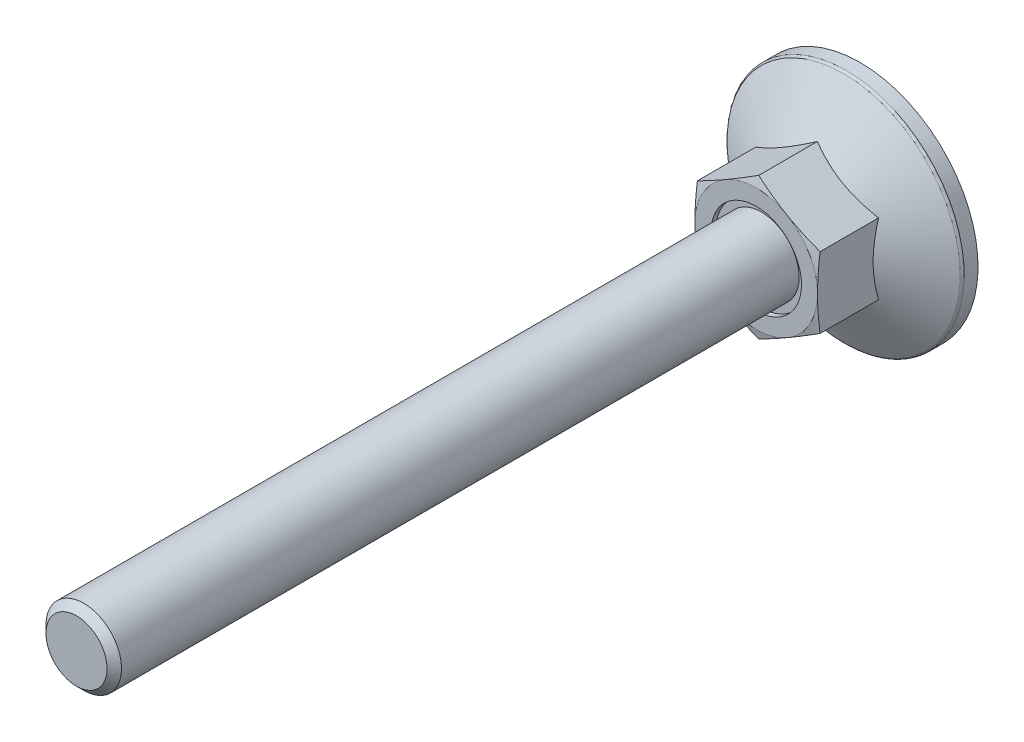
ISO-10303-21;
HEADER;
FILE_DESCRIPTION(('STEP AP214'),'2;1');
FILE_NAME('part.step','',(''),(''),'','','');
FILE_SCHEMA(('AUTOMOTIVE_DESIGN { 1 0 10303 214 1 1 1 1 }'));
ENDSEC;
DATA;
#1=APPLICATION_CONTEXT('core data for automotive mechanical design processes');
#2=APPLICATION_PROTOCOL_DEFINITION('international standard','automotive_design',2000,#1);
#3=PRODUCT_CONTEXT('',#1,'mechanical');
#4=PRODUCT('Part','Part','',(#3));
#5=PRODUCT_RELATED_PRODUCT_CATEGORY('part','',(#4));
#6=PRODUCT_DEFINITION_FORMATION('','',#4);
#7=PRODUCT_DEFINITION_CONTEXT('part definition',#1,'design');
#8=PRODUCT_DEFINITION('design','',#6,#7);
#9=PRODUCT_DEFINITION_SHAPE('','',#8);
#10=(LENGTH_UNIT() NAMED_UNIT(*) SI_UNIT(.MILLI.,.METRE.));
#11=(NAMED_UNIT(*) PLANE_ANGLE_UNIT() SI_UNIT($,.RADIAN.));
#12=(NAMED_UNIT(*) SI_UNIT($,.STERADIAN.) SOLID_ANGLE_UNIT());
#13=UNCERTAINTY_MEASURE_WITH_UNIT(LENGTH_MEASURE(1.E-05),#10,'distance_accuracy_value','');
#14=(GEOMETRIC_REPRESENTATION_CONTEXT(3) GLOBAL_UNCERTAINTY_ASSIGNED_CONTEXT((#13)) GLOBAL_UNIT_ASSIGNED_CONTEXT((#10,
#11,#12)) REPRESENTATION_CONTEXT('',''));
#15=CARTESIAN_POINT('',(0.,0.,0.));
#16=DIRECTION('',(0.,0.,1.));
#17=DIRECTION('',(1.,0.,0.));
#18=AXIS2_PLACEMENT_3D('',#15,#16,#17);
#19=CARTESIAN_POINT('',(0.,0.,10.45));
#20=DIRECTION('',(0.,0.,-1.));
#21=DIRECTION('',(0.,1.,0.));
#22=AXIS2_PLACEMENT_3D('',#19,#20,#21);
#23=PLANE('',#22);
#24=CARTESIAN_POINT('',(0.,0.,10.45));
#25=DIRECTION('',(0.,0.,-1.));
#26=DIRECTION('',(0.,1.,0.));
#27=AXIS2_PLACEMENT_3D('',#24,#25,#26);
#28=CIRCLE('',#27,4.8);
#29=CARTESIAN_POINT('',(0.,4.8,10.45));
#30=VERTEX_POINT('',#29);
#31=EDGE_CURVE('E27',#30,#30,#28,.T.);
#32=ORIENTED_EDGE('',*,*,#31,.F.);
#33=EDGE_LOOP('',(#32));
#34=FACE_BOUND('',#33,.T.);
#35=CARTESIAN_POINT('',(0.,0.,10.45));
#36=DIRECTION('',(0.,0.,-1.));
#37=DIRECTION('',(0.,1.,0.));
#38=AXIS2_PLACEMENT_3D('',#35,#36,#37);
#39=CIRCLE('',#38,4.);
#40=CARTESIAN_POINT('',(0.,4.,10.45));
#41=VERTEX_POINT('',#40);
#42=EDGE_CURVE('E252',#41,#41,#39,.F.);
#43=ORIENTED_EDGE('',*,*,#42,.F.);
#44=EDGE_LOOP('',(#43));
#45=FACE_BOUND('',#44,.T.);
#46=ADVANCED_FACE('F14',(#34,#45),#23,.F.);
#47=CARTESIAN_POINT('',(0.,7.5055534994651,22.));
#48=DIRECTION('',(0.499999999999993,-0.866025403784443,0.));
#49=DIRECTION('',(0.866025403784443,0.499999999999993,0.));
#50=AXIS2_PLACEMENT_3D('',#47,#48,#49);
#51=PLANE('',#50);
#52=CARTESIAN_POINT('',(-6.5002,3.75266127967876,4.53347836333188));
#53=CARTESIAN_POINT('',(-6.35732254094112,3.83515161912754,4.58109719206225));
#54=CARTESIAN_POINT('',(-6.21391236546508,3.91794952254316,4.62655491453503));
#55=CARTESIAN_POINT('',(-5.9259273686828,4.08421773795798,4.71255293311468));
#56=CARTESIAN_POINT('',(-5.78135207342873,4.16768832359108,4.7530911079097));
#57=CARTESIAN_POINT('',(-5.34531134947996,4.41943655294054,4.86653061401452));
#58=CARTESIAN_POINT('',(-5.05212471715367,4.58870793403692,4.93105380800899));
#59=CARTESIAN_POINT('',(-4.61337625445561,4.84201947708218,5.00671503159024));
#60=CARTESIAN_POINT('',(-4.46912536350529,4.92530276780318,5.02826875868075));
#61=CARTESIAN_POINT('',(-4.17997178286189,5.09224566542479,5.06441130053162));
#62=CARTESIAN_POINT('',(-4.03506915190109,5.17590523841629,5.07900073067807));
#63=CARTESIAN_POINT('',(-3.74501222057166,5.34336968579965,5.10084286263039));
#64=CARTESIAN_POINT('',(-3.59985839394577,5.42717428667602,5.10810389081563));
#65=CARTESIAN_POINT('',(-3.30942466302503,5.59485627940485,5.11514131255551));
#66=CARTESIAN_POINT('',(-3.16414476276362,5.67873366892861,5.11491793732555));
#67=CARTESIAN_POINT('',(-2.76612405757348,5.90853103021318,5.1040181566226));
#68=CARTESIAN_POINT('',(-2.51351353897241,6.05437578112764,5.08571979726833));
#69=CARTESIAN_POINT('',(-2.00997032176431,6.34509659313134,5.02769527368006));
#70=CARTESIAN_POINT('',(-1.75903939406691,6.48997163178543,4.9879492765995));
#71=CARTESIAN_POINT('',(-1.25448277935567,6.78127752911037,4.8885957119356));
#72=CARTESIAN_POINT('',(-1.00092075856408,6.92767163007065,4.82856718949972));
#73=CARTESIAN_POINT('',(-0.497578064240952,7.21827667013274,4.69232662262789));
#74=CARTESIAN_POINT('',(-0.247790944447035,7.36249133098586,4.61614658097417));
#75=CARTESIAN_POINT('',(0.000200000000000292,7.50566896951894,4.53347836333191));
#76=B_SPLINE_CURVE_WITH_KNOTS('',3,(#52,#53,#54,#55,#56,#57,#58,#59,#60,#61,#62,#63,#64,#65,#66,
#67,#68,#69,#70,#71,#72,#73,#74,#75),.UNSPECIFIED.,.F.,.F.,(4,2,2,2,2,2,2,2,2,2,2,4),(0.,
0.515105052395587,1.03043143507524,2.06322554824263,2.56697389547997,3.07067772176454,
3.57380860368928,4.07692394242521,4.95279354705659,5.82947446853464,6.72559912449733,
7.61996451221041),.UNSPECIFIED.);
#77=CARTESIAN_POINT('',(-6.5,3.7527767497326,4.53354503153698));
#78=VERTEX_POINT('',#77);
#79=CARTESIAN_POINT('',(0.,7.5055534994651,4.53354503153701));
#80=VERTEX_POINT('',#79);
#81=EDGE_CURVE('E100',#78,#80,#76,.T.);
#82=ORIENTED_EDGE('',*,*,#81,.F.);
#83=DIRECTION('',(0.,0.,-1.));
#84=VECTOR('',#83,1.);
#85=CARTESIAN_POINT('',(-6.5,3.7527767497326,22.));
#86=LINE('',#85,#84);
#87=CARTESIAN_POINT('',(-6.5,3.7527767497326,10.7305627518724));
#88=VERTEX_POINT('',#87);
#89=EDGE_CURVE('E91',#88,#78,#86,.T.);
#90=ORIENTED_EDGE('',*,*,#89,.F.);
#91=CARTESIAN_POINT('',(0.000200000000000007,7.50566896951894,10.7305318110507));
#92=CARTESIAN_POINT('',(-0.269745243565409,7.34981601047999,10.7723102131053));
#93=CARTESIAN_POINT('',(-0.540179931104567,7.19368047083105,10.8102381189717));
#94=CARTESIAN_POINT('',(-1.08200437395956,6.8808579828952,10.876873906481));
#95=CARTESIAN_POINT('',(-1.35339447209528,6.72417083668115,10.9055780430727));
#96=CARTESIAN_POINT('',(-1.89548428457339,6.41119513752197,10.952090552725));
#97=CARTESIAN_POINT('',(-2.16618033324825,6.25490870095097,10.9699543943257));
#98=CARTESIAN_POINT('',(-2.70791763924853,5.94213652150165,10.9939079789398));
#99=CARTESIAN_POINT('',(-2.97895881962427,5.78565082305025,11.));
#100=CARTESIAN_POINT('',(-3.52104118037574,5.47267942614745,11.));
#101=CARTESIAN_POINT('',(-3.79208236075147,5.31619372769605,10.9939079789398));
#102=CARTESIAN_POINT('',(-4.33381966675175,5.00342154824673,10.9699543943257));
#103=CARTESIAN_POINT('',(-4.60451571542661,4.84713511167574,10.952090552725));
#104=CARTESIAN_POINT('',(-5.14660552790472,4.53415941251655,10.9055780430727));
#105=CARTESIAN_POINT('',(-5.41799562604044,4.3774722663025,10.876873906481));
#106=CARTESIAN_POINT('',(-5.95982006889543,4.06464977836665,10.8102381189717));
#107=CARTESIAN_POINT('',(-6.23025475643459,3.90851423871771,10.7723102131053));
#108=CARTESIAN_POINT('',(-6.5002,3.75266127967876,10.7305318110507));
#109=B_SPLINE_CURVE_WITH_KNOTS('',3,(#91,#92,#93,#94,#95,#96,#97,#98,#99,#100,#101,#102,#103,
#104,#105,#106,#107,#108),.UNSPECIFIED.,.F.,.F.,(4,2,2,2,2,2,2,2,4),(0.,0.943529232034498,
1.88744107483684,2.82648138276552,3.76533995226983,4.70419852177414,5.64323882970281,
6.58715067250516,7.53067990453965),.UNSPECIFIED.);
#110=CARTESIAN_POINT('',(-3.24999999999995,5.62916512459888,11.));
#111=VERTEX_POINT('',#110);
#112=EDGE_CURVE('E191',#111,#88,#109,.T.);
#113=ORIENTED_EDGE('',*,*,#112,.F.);
#114=CARTESIAN_POINT('',(0.,7.5055534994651,10.7305627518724));
#115=VERTEX_POINT('',#114);
#116=EDGE_CURVE('E478',#115,#111,#109,.T.);
#117=ORIENTED_EDGE('',*,*,#116,.F.);
#118=DIRECTION('',(0.,0.,-1.));
#119=VECTOR('',#118,1.);
#120=CARTESIAN_POINT('',(0.,7.5055534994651,22.));
#121=LINE('',#120,#119);
#122=EDGE_CURVE('E104',#115,#80,#121,.T.);
#123=ORIENTED_EDGE('',*,*,#122,.T.);
#124=EDGE_LOOP('',(#82,#90,#113,#117,#123));
#125=FACE_BOUND('',#124,.T.);
#126=ADVANCED_FACE('F103',(#125),#51,.F.);
#127=CARTESIAN_POINT('',(6.5,3.7527767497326,22.));
#128=DIRECTION('',(-0.499999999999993,-0.866025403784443,0.));
#129=DIRECTION('',(0.866025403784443,-0.499999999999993,0.));
#130=AXIS2_PLACEMENT_3D('',#127,#128,#129);
#131=PLANE('',#130);
#132=CARTESIAN_POINT('',(-0.0002,7.50566896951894,4.53347836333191));
#133=CARTESIAN_POINT('',(0.142677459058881,7.42317863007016,4.58109719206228));
#134=CARTESIAN_POINT('',(0.286087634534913,7.34038072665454,4.62655491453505));
#135=CARTESIAN_POINT('',(0.574072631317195,7.17411251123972,4.71255293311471));
#136=CARTESIAN_POINT('',(0.718647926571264,7.09064192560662,4.75309110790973));
#137=CARTESIAN_POINT('',(1.15468865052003,6.83889369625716,4.86653061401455));
#138=CARTESIAN_POINT('',(1.44787528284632,6.66962231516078,4.93105380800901));
#139=CARTESIAN_POINT('',(1.88662374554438,6.41631077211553,5.00671503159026));
#140=CARTESIAN_POINT('',(2.03087463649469,6.33302748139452,5.02826875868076));
#141=CARTESIAN_POINT('',(2.32002821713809,6.16608458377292,5.06441130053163));
#142=CARTESIAN_POINT('',(2.46493084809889,6.08242501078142,5.07900073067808));
#143=CARTESIAN_POINT('',(2.75498777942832,5.91496056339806,5.10084286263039));
#144=CARTESIAN_POINT('',(2.90014160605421,5.8311559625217,5.10810389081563));
#145=CARTESIAN_POINT('',(3.19057533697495,5.66347396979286,5.11514131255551));
#146=CARTESIAN_POINT('',(3.33585523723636,5.5795965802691,5.11491793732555));
#147=CARTESIAN_POINT('',(3.73387594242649,5.34979921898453,5.10401815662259));
#148=CARTESIAN_POINT('',(3.98648646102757,5.20395446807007,5.08571979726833));
#149=CARTESIAN_POINT('',(4.49002967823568,4.91323365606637,5.02769527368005));
#150=CARTESIAN_POINT('',(4.74096060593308,4.76835861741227,4.98794927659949));
#151=CARTESIAN_POINT('',(5.24551722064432,4.47705272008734,4.88859571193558));
#152=CARTESIAN_POINT('',(5.49907924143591,4.33065861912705,4.8285671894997));
#153=CARTESIAN_POINT('',(6.00242193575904,4.04005357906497,4.69232662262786));
#154=CARTESIAN_POINT('',(6.25220905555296,3.89583891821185,4.61614658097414));
#155=CARTESIAN_POINT('',(6.5002,3.75266127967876,4.53347836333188));
#156=B_SPLINE_CURVE_WITH_KNOTS('',3,(#132,#133,#134,#135,#136,#137,#138,#139,#140,#141,#142,
#143,#144,#145,#146,#147,#148,#149,#150,#151,#152,#153,#154,#155),.UNSPECIFIED.,.F.,.F.,(4,2,2,
2,2,2,2,2,2,2,2,4),(0.,0.515105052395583,1.03043143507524,2.06322554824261,2.56697389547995,
3.07067772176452,3.57380860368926,4.07692394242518,4.95279354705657,5.82947446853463,
6.72559912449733,7.61996451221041),.UNSPECIFIED.);
#157=CARTESIAN_POINT('',(6.5,3.7527767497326,4.53354503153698));
#158=VERTEX_POINT('',#157);
#159=EDGE_CURVE('E34',#80,#158,#156,.T.);
#160=ORIENTED_EDGE('',*,*,#159,.F.);
#161=ORIENTED_EDGE('',*,*,#122,.F.);
#162=CARTESIAN_POINT('',(6.5002,3.75266127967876,10.7305318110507));
#163=CARTESIAN_POINT('',(6.23025475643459,3.90851423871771,10.7723102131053));
#164=CARTESIAN_POINT('',(5.95982006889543,4.06464977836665,10.8102381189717));
#165=CARTESIAN_POINT('',(5.41799562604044,4.37747226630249,10.876873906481));
#166=CARTESIAN_POINT('',(5.14660552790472,4.53415941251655,10.9055780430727));
#167=CARTESIAN_POINT('',(4.60451571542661,4.84713511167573,10.952090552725));
#168=CARTESIAN_POINT('',(4.33381966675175,5.00342154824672,10.9699543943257));
#169=CARTESIAN_POINT('',(3.79208236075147,5.31619372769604,10.9939079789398));
#170=CARTESIAN_POINT('',(3.52104118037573,5.47267942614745,11.));
#171=CARTESIAN_POINT('',(2.97895881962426,5.78565082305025,11.));
#172=CARTESIAN_POINT('',(2.70791763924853,5.94213652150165,10.9939079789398));
#173=CARTESIAN_POINT('',(2.16618033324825,6.25490870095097,10.9699543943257));
#174=CARTESIAN_POINT('',(1.89548428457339,6.41119513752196,10.952090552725));
#175=CARTESIAN_POINT('',(1.35339447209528,6.72417083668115,10.9055780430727));
#176=CARTESIAN_POINT('',(1.08200437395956,6.8808579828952,10.876873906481));
#177=CARTESIAN_POINT('',(0.540179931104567,7.19368047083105,10.8102381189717));
#178=CARTESIAN_POINT('',(0.26974524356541,7.34981601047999,10.7723102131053));
#179=CARTESIAN_POINT('',(-0.000199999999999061,7.50566896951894,10.7305318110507));
#180=B_SPLINE_CURVE_WITH_KNOTS('',3,(#162,#163,#164,#165,#166,#167,#168,#169,#170,#171,#172,
#173,#174,#175,#176,#177,#178,#179),.UNSPECIFIED.,.F.,.F.,(4,2,2,2,2,2,2,2,4),(0.,
0.943529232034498,1.88744107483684,2.82648138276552,3.76533995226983,4.70419852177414,
5.64323882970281,6.58715067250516,7.53067990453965),.UNSPECIFIED.);
#181=CARTESIAN_POINT('',(3.24999999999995,5.62916512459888,11.));
#182=VERTEX_POINT('',#181);
#183=EDGE_CURVE('E175',#182,#115,#180,.T.);
#184=ORIENTED_EDGE('',*,*,#183,.F.);
#185=CARTESIAN_POINT('',(6.5,3.7527767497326,10.7305627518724));
#186=VERTEX_POINT('',#185);
#187=EDGE_CURVE('E183',#186,#182,#180,.T.);
#188=ORIENTED_EDGE('',*,*,#187,.F.);
#189=DIRECTION('',(0.,0.,-1.));
#190=VECTOR('',#189,1.);
#191=CARTESIAN_POINT('',(6.5,3.7527767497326,22.));
#192=LINE('',#191,#190);
#193=EDGE_CURVE('E481',#186,#158,#192,.T.);
#194=ORIENTED_EDGE('',*,*,#193,.T.);
#195=EDGE_LOOP('',(#160,#161,#184,#188,#194));
#196=FACE_BOUND('',#195,.T.);
#197=ADVANCED_FACE('F165',(#196),#131,.F.);
#198=CARTESIAN_POINT('',(6.5,-3.7527767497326,22.));
#199=DIRECTION('',(-1.,0.,0.));
#200=DIRECTION('',(0.,-1.,0.));
#201=AXIS2_PLACEMENT_3D('',#198,#199,#200);
#202=PLANE('',#201);
#203=CARTESIAN_POINT('',(6.5,10.067414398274,1.94823609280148));
#204=CARTESIAN_POINT('',(6.5,9.78352438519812,2.0858958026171));
#205=CARTESIAN_POINT('',(6.5,9.49898106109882,2.22223138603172));
#206=CARTESIAN_POINT('',(6.5,8.9282401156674,2.49150895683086));
#207=CARTESIAN_POINT('',(6.5,8.64204224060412,2.62445040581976));
#208=CARTESIAN_POINT('',(6.5,8.06616487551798,2.88686541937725));
#209=CARTESIAN_POINT('',(6.5,7.77647490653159,3.01631606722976));
#210=CARTESIAN_POINT('',(6.5,7.19478507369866,3.26989907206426));
#211=CARTESIAN_POINT('',(6.5,6.90278532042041,3.3940316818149));
#212=CARTESIAN_POINT('',(6.5,6.30684739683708,3.6393457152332));
#213=CARTESIAN_POINT('',(6.5,6.00282105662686,3.76031411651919));
#214=CARTESIAN_POINT('',(6.5,5.39120706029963,3.99306391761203));
#215=CARTESIAN_POINT('',(6.5,5.08361900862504,4.10484428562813));
#216=CARTESIAN_POINT('',(6.5,4.46497231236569,4.31627594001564));
#217=CARTESIAN_POINT('',(6.5,4.15392216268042,4.41595183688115));
#218=CARTESIAN_POINT('',(6.5,3.52735818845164,4.59996747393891));
#219=CARTESIAN_POINT('',(6.5,3.21184580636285,4.6843120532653));
#220=CARTESIAN_POINT('',(6.5,2.57783458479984,4.83319256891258));
#221=CARTESIAN_POINT('',(6.5,2.25935972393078,4.8978289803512));
#222=CARTESIAN_POINT('',(6.5,1.61842059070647,5.00357646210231));
#223=CARTESIAN_POINT('',(6.5,1.29595672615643,5.04468991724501));
#224=CARTESIAN_POINT('',(6.5,0.812693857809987,5.08598811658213));
#225=CARTESIAN_POINT('',(6.5,0.652724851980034,5.09635596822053));
#226=CARTESIAN_POINT('',(6.5,0.332484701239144,5.110324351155));
#227=CARTESIAN_POINT('',(6.5,0.172213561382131,5.11392499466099));
#228=CARTESIAN_POINT('',(6.5,-0.148338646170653,5.11426557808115));
#229=CARTESIAN_POINT('',(6.5,-0.308619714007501,5.11100536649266));
#230=CARTESIAN_POINT('',(6.5,-0.628902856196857,5.09770543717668));
#231=CARTESIAN_POINT('',(6.5,-0.788904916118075,5.08766537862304));
#232=CARTESIAN_POINT('',(6.5,-1.1736673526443,5.05558094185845));
#233=CARTESIAN_POINT('',(6.5,-1.39816400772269,5.03030719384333));
#234=CARTESIAN_POINT('',(6.5,-1.84547349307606,4.96779217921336));
#235=CARTESIAN_POINT('',(6.5,-2.06828609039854,4.93054928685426));
#236=CARTESIAN_POINT('',(6.5,-2.73393776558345,4.80284369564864));
#237=CARTESIAN_POINT('',(6.5,-3.17375537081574,4.69642628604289));
#238=CARTESIAN_POINT('',(6.5,-3.83171733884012,4.51203063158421));
#239=CARTESIAN_POINT('',(6.5,-4.0532725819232,4.44552609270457));
#240=CARTESIAN_POINT('',(6.5,-4.49422901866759,4.30565892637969));
#241=CARTESIAN_POINT('',(6.5,-4.7136301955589,4.23229624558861));
#242=CARTESIAN_POINT('',(6.5,-5.15035386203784,4.07988627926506));
#243=CARTESIAN_POINT('',(6.5,-5.36767698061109,4.00084077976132));
#244=CARTESIAN_POINT('',(6.5,-5.800520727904,3.83799065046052));
#245=CARTESIAN_POINT('',(6.5,-6.01604140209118,3.75418614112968));
#246=CARTESIAN_POINT('',(6.5,-6.61842771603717,3.5135303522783));
#247=CARTESIAN_POINT('',(6.5,-7.00350435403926,3.35220459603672));
#248=CARTESIAN_POINT('',(6.5,-7.76959629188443,3.02014813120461));
#249=CARTESIAN_POINT('',(6.5,-8.15061109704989,2.84941629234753));
#250=CARTESIAN_POINT('',(6.5,-8.90957192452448,2.50088582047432));
#251=CARTESIAN_POINT('',(6.5,-9.28751663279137,2.32308433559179));
#252=CARTESIAN_POINT('',(6.5,-10.0408394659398,1.96218611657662));
#253=CARTESIAN_POINT('',(6.5,-10.4162177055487,1.77908962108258));
#254=CARTESIAN_POINT('',(6.5,-11.1655631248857,1.40849620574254));
#255=CARTESIAN_POINT('',(6.5,-11.5395269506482,1.22099251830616));
#256=CARTESIAN_POINT('',(6.5,-12.2858210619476,0.842758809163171));
#257=CARTESIAN_POINT('',(6.5,-12.6581513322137,0.652028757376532));
#258=CARTESIAN_POINT('',(6.5,-13.4013949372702,0.268043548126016));
#259=CARTESIAN_POINT('',(6.5,-13.7723085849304,0.0747889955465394));
#260=CARTESIAN_POINT('',(6.5,-14.5130449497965,-0.313800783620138));
#261=CARTESIAN_POINT('',(6.5,-14.8828676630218,-0.509136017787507));
#262=CARTESIAN_POINT('',(6.5,-15.9085714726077,-1.05391022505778));
#263=CARTESIAN_POINT('',(6.5,-16.5634819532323,-1.40517623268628));
#264=CARTESIAN_POINT('',(6.5,-17.871267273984,-2.11157255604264));
#265=CARTESIAN_POINT('',(6.5,-18.5241419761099,-2.46670312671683));
#266=CARTESIAN_POINT('',(6.5,-19.8261496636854,-3.17862531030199));
#267=CARTESIAN_POINT('',(6.5,-20.4752878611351,-3.53540739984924));
#268=CARTESIAN_POINT('',(6.5,-21.7722968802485,-4.25114422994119));
#269=CARTESIAN_POINT('',(6.5,-22.4201678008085,-4.61009879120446));
#270=CARTESIAN_POINT('',(6.5,-23.0675997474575,-4.9698379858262));
#271=B_SPLINE_CURVE_WITH_KNOTS('',3,(#203,#204,#205,#206,#207,#208,#209,#210,#211,#212,#213,
#214,#215,#216,#217,#218,#219,#220,#221,#222,#223,#224,#225,#226,#227,#228,#229,#230,#231,#232,
#233,#234,#235,#236,#237,#238,#239,#240,#241,#242,#243,#244,#245,#246,#247,#248,#249,#250,#251,
#252,#253,#254,#255,#256,#257,#258,#259,#260,#261,#262,#263,#264,#265,#266,#267,#268,#269,#270),
.UNSPECIFIED.,.F.,.F.,(4,2,2,2,2,2,2,2,2,2,2,2,2,2,2,2,2,2,2,2,2,2,2,2,2,2,2,2,2,2,2,2,2,4),(0.,
0.94652822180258,1.89320566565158,2.84505559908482,3.79686024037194,4.77837094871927,
5.75999172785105,6.73958204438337,7.71886262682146,8.69306383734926,9.66716626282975,
10.1479587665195,10.6287432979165,11.1095384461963,11.5903577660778,12.267719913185,
12.9451741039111,14.3007885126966,14.9946950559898,15.6886069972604,16.3823017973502,
17.0759790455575,18.3282990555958,19.5807698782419,20.8337511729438,22.086676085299,
23.3416700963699,24.5966758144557,25.8513861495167,27.1061010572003,29.3355785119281,
31.5652039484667,33.7873748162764,36.0093647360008),.UNSPECIFIED.);
#272=CARTESIAN_POINT('',(6.5,-3.7527767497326,4.53354503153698));
#273=VERTEX_POINT('',#272);
#274=EDGE_CURVE('E42',#158,#273,#271,.T.);
#275=ORIENTED_EDGE('',*,*,#274,.F.);
#276=ORIENTED_EDGE('',*,*,#193,.F.);
#277=CARTESIAN_POINT('',(6.5,9.92747995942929,9.56215186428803));
#278=CARTESIAN_POINT('',(6.5,9.63259364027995,9.62823955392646));
#279=CARTESIAN_POINT('',(6.5,9.33752287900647,9.69351898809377));
#280=CARTESIAN_POINT('',(6.5,8.74692189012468,9.82202506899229));
#281=CARTESIAN_POINT('',(6.5,8.45139164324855,9.88525162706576));
#282=CARTESIAN_POINT('',(6.5,7.85951636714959,10.0092707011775));
#283=CARTESIAN_POINT('',(6.5,7.56317082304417,10.0700607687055));
#284=CARTESIAN_POINT('',(6.5,6.9698629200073,10.1885506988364));
#285=CARTESIAN_POINT('',(6.5,6.67290056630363,10.2462505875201));
#286=CARTESIAN_POINT('',(6.5,6.08062010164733,10.3573796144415));
#287=CARTESIAN_POINT('',(6.5,5.78530770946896,10.410839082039));
#288=CARTESIAN_POINT('',(6.5,5.19387740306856,10.5130907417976));
#289=CARTESIAN_POINT('',(6.5,4.89775950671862,10.5618830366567));
#290=CARTESIAN_POINT('',(6.5,4.30466070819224,10.6537017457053));
#291=CARTESIAN_POINT('',(6.5,4.00767991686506,10.69672886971));
#292=CARTESIAN_POINT('',(6.5,3.41277328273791,10.7757492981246));
#293=CARTESIAN_POINT('',(6.5,3.11484743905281,10.8117425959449));
#294=CARTESIAN_POINT('',(6.5,2.51468954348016,10.8756761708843));
#295=CARTESIAN_POINT('',(6.5,2.21244707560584,10.9035201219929));
#296=CARTESIAN_POINT('',(6.5,1.60720229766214,10.9492341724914));
#297=CARTESIAN_POINT('',(6.5,1.30420000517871,10.9671045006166));
#298=CARTESIAN_POINT('',(6.5,0.697875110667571,10.9918290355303));
#299=CARTESIAN_POINT('',(6.5,0.394552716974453,10.9986882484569));
#300=CARTESIAN_POINT('',(6.5,-0.212135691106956,11.0009688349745));
#301=CARTESIAN_POINT('',(6.5,-0.515501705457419,10.9963902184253));
#302=CARTESIAN_POINT('',(6.5,-1.1229550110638,10.9760526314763));
#303=CARTESIAN_POINT('',(6.5,-1.42704091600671,10.9602530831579));
#304=CARTESIAN_POINT('',(6.5,-2.03449758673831,10.918375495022));
#305=CARTESIAN_POINT('',(6.5,-2.33786833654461,10.892297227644));
#306=CARTESIAN_POINT('',(6.5,-2.94389214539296,10.8311794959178));
#307=CARTESIAN_POINT('',(6.5,-3.24654460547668,10.7961341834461));
#308=CARTESIAN_POINT('',(6.5,-3.85087551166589,10.7185406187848));
#309=CARTESIAN_POINT('',(6.5,-4.15255395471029,10.6759923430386));
#310=CARTESIAN_POINT('',(6.5,-4.73502363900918,10.5877746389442));
#311=CARTESIAN_POINT('',(6.5,-5.01587505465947,10.5424985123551));
#312=CARTESIAN_POINT('',(6.5,-5.57683763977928,10.4475514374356));
#313=CARTESIAN_POINT('',(6.5,-5.85694878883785,10.3978803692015));
#314=CARTESIAN_POINT('',(6.5,-6.41653333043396,10.2949474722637));
#315=CARTESIAN_POINT('',(6.5,-6.69600666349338,10.2416853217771));
#316=CARTESIAN_POINT('',(6.5,-7.25437933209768,10.132225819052));
#317=CARTESIAN_POINT('',(6.5,-7.53327866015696,10.0760284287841));
#318=CARTESIAN_POINT('',(6.5,-8.36936246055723,9.90383082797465));
#319=CARTESIAN_POINT('',(6.5,-8.9258084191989,9.78424858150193));
#320=CARTESIAN_POINT('',(6.5,-10.0372205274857,9.53861051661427));
#321=CARTESIAN_POINT('',(6.5,-10.5921867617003,9.41255507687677));
#322=CARTESIAN_POINT('',(6.5,-11.6956125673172,9.15714489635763));
#323=CARTESIAN_POINT('',(6.5,-12.244082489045,9.02783474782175));
#324=CARTESIAN_POINT('',(6.5,-13.3402571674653,8.76597711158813));
#325=CARTESIAN_POINT('',(6.5,-13.8879619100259,8.6334295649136));
#326=CARTESIAN_POINT('',(6.5,-14.9821103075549,8.36610757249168));
#327=CARTESIAN_POINT('',(6.5,-15.528554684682,8.23133607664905));
#328=CARTESIAN_POINT('',(6.5,-16.6209674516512,7.95995280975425));
#329=CARTESIAN_POINT('',(6.5,-17.1669358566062,7.82334109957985));
#330=CARTESIAN_POINT('',(6.5,-17.7127383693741,7.6860776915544));
#331=B_SPLINE_CURVE_WITH_KNOTS('',3,(#277,#278,#279,#280,#281,#282,#283,#284,#285,#286,#287,
#288,#289,#290,#291,#292,#293,#294,#295,#296,#297,#298,#299,#300,#301,#302,#303,#304,#305,#306,
#307,#308,#309,#310,#311,#312,#313,#314,#315,#316,#317,#318,#319,#320,#321,#322,#323,#324,#325,
#326,#327,#328,#329,#330),.UNSPECIFIED.,.F.,.F.,(4,2,2,2,2,2,2,2,2,2,2,2,2,2,2,2,2,2,2,2,2,2,2,
2,2,2,4),(0.,0.906607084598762,1.8132532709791,2.72078883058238,3.62831672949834,
4.52862337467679,5.42891020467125,6.32908608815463,7.22926281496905,8.13968571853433,
9.05008774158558,9.96007573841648,10.8700629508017,11.7833577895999,12.6966728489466,
13.6105850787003,14.5245001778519,15.3778915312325,16.2313061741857,17.084797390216,
17.9382996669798,19.6456836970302,21.3529679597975,23.0434756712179,24.7340142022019,
26.4224665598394,28.1108631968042),.UNSPECIFIED.);
#332=CARTESIAN_POINT('',(6.5,0.,11.));
#333=VERTEX_POINT('',#332);
#334=EDGE_CURVE('E185',#333,#186,#331,.F.);
#335=ORIENTED_EDGE('',*,*,#334,.F.);
#336=CARTESIAN_POINT('',(6.5,-3.7527767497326,10.7305627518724));
#337=VERTEX_POINT('',#336);
#338=EDGE_CURVE('E184',#337,#333,#331,.F.);
#339=ORIENTED_EDGE('',*,*,#338,.F.);
#340=DIRECTION('',(0.,0.,-1.));
#341=VECTOR('',#340,1.);
#342=CARTESIAN_POINT('',(6.5,-3.7527767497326,22.));
#343=LINE('',#342,#341);
#344=EDGE_CURVE('E453',#337,#273,#343,.T.);
#345=ORIENTED_EDGE('',*,*,#344,.T.);
#346=EDGE_LOOP('',(#275,#276,#335,#339,#345));
#347=FACE_BOUND('',#346,.T.);
#348=ADVANCED_FACE('F169',(#347),#202,.F.);
#349=CARTESIAN_POINT('',(0.,-7.5055534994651,22.));
#350=DIRECTION('',(-0.499999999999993,0.866025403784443,0.));
#351=DIRECTION('',(-0.866025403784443,-0.499999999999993,0.));
#352=AXIS2_PLACEMENT_3D('',#349,#350,#351);
#353=PLANE('',#352);
#354=CARTESIAN_POINT('',(6.5002,-3.75266127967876,4.53347836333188));
#355=CARTESIAN_POINT('',(6.35732254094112,-3.83515161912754,4.58109719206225));
#356=CARTESIAN_POINT('',(6.21391236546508,-3.91794952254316,4.62655491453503));
#357=CARTESIAN_POINT('',(5.9259273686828,-4.08421773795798,4.71255293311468));
#358=CARTESIAN_POINT('',(5.78135207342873,-4.16768832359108,4.7530911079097));
#359=CARTESIAN_POINT('',(5.34531134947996,-4.41943655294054,4.86653061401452));
#360=CARTESIAN_POINT('',(5.05212471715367,-4.58870793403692,4.93105380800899));
#361=CARTESIAN_POINT('',(4.61337625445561,-4.84201947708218,5.00671503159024));
#362=CARTESIAN_POINT('',(4.46912536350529,-4.92530276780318,5.02826875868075));
#363=CARTESIAN_POINT('',(4.17997178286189,-5.09224566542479,5.06441130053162));
#364=CARTESIAN_POINT('',(4.03506915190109,-5.17590523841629,5.07900073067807));
#365=CARTESIAN_POINT('',(3.74501222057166,-5.34336968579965,5.10084286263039));
#366=CARTESIAN_POINT('',(3.59985839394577,-5.42717428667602,5.10810389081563));
#367=CARTESIAN_POINT('',(3.30942466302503,-5.59485627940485,5.11514131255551));
#368=CARTESIAN_POINT('',(3.16414476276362,-5.67873366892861,5.11491793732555));
#369=CARTESIAN_POINT('',(2.76612405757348,-5.90853103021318,5.1040181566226));
#370=CARTESIAN_POINT('',(2.51351353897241,-6.05437578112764,5.08571979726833));
#371=CARTESIAN_POINT('',(2.00997032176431,-6.34509659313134,5.02769527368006));
#372=CARTESIAN_POINT('',(1.75903939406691,-6.48997163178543,4.9879492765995));
#373=CARTESIAN_POINT('',(1.25448277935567,-6.78127752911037,4.8885957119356));
#374=CARTESIAN_POINT('',(1.00092075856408,-6.92767163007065,4.82856718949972));
#375=CARTESIAN_POINT('',(0.497578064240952,-7.21827667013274,4.69232662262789));
#376=CARTESIAN_POINT('',(0.247790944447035,-7.36249133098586,4.61614658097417));
#377=CARTESIAN_POINT('',(-0.000200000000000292,-7.50566896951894,4.53347836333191));
#378=B_SPLINE_CURVE_WITH_KNOTS('',3,(#354,#355,#356,#357,#358,#359,#360,#361,#362,#363,#364,
#365,#366,#367,#368,#369,#370,#371,#372,#373,#374,#375,#376,#377),.UNSPECIFIED.,.F.,.F.,(4,2,2,
2,2,2,2,2,2,2,2,4),(0.,0.515105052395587,1.03043143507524,2.06322554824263,2.56697389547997,
3.07067772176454,3.57380860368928,4.07692394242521,4.95279354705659,5.82947446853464,
6.72559912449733,7.61996451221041),.UNSPECIFIED.);
#379=CARTESIAN_POINT('',(0.,-7.5055534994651,4.53354503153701));
#380=VERTEX_POINT('',#379);
#381=EDGE_CURVE('E112',#273,#380,#378,.T.);
#382=ORIENTED_EDGE('',*,*,#381,.F.);
#383=ORIENTED_EDGE('',*,*,#344,.F.);
#384=CARTESIAN_POINT('',(-0.000200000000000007,-7.50566896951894,10.7305318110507));
#385=CARTESIAN_POINT('',(0.269745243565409,-7.34981601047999,10.7723102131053));
#386=CARTESIAN_POINT('',(0.540179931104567,-7.19368047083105,10.8102381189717));
#387=CARTESIAN_POINT('',(1.08200437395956,-6.8808579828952,10.876873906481));
#388=CARTESIAN_POINT('',(1.35339447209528,-6.72417083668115,10.9055780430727));
#389=CARTESIAN_POINT('',(1.89548428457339,-6.41119513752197,10.952090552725));
#390=CARTESIAN_POINT('',(2.16618033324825,-6.25490870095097,10.9699543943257));
#391=CARTESIAN_POINT('',(2.70791763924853,-5.94213652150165,10.9939079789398));
#392=CARTESIAN_POINT('',(2.97895881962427,-5.78565082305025,11.));
#393=CARTESIAN_POINT('',(3.52104118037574,-5.47267942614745,11.));
#394=CARTESIAN_POINT('',(3.79208236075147,-5.31619372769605,10.9939079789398));
#395=CARTESIAN_POINT('',(4.33381966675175,-5.00342154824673,10.9699543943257));
#396=CARTESIAN_POINT('',(4.60451571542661,-4.84713511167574,10.952090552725));
#397=CARTESIAN_POINT('',(5.14660552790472,-4.53415941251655,10.9055780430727));
#398=CARTESIAN_POINT('',(5.41799562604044,-4.3774722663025,10.876873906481));
#399=CARTESIAN_POINT('',(5.95982006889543,-4.06464977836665,10.8102381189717));
#400=CARTESIAN_POINT('',(6.23025475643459,-3.90851423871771,10.7723102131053));
#401=CARTESIAN_POINT('',(6.5002,-3.75266127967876,10.7305318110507));
#402=B_SPLINE_CURVE_WITH_KNOTS('',3,(#384,#385,#386,#387,#388,#389,#390,#391,#392,#393,#394,
#395,#396,#397,#398,#399,#400,#401),.UNSPECIFIED.,.F.,.F.,(4,2,2,2,2,2,2,2,4),(0.,
0.943529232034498,1.88744107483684,2.82648138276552,3.76533995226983,4.70419852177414,
5.64323882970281,6.58715067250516,7.53067990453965),.UNSPECIFIED.);
#403=CARTESIAN_POINT('',(3.24999999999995,-5.62916512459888,11.));
#404=VERTEX_POINT('',#403);
#405=EDGE_CURVE('E222',#404,#337,#402,.T.);
#406=ORIENTED_EDGE('',*,*,#405,.F.);
#407=CARTESIAN_POINT('',(0.,-7.5055534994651,10.7305627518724));
#408=VERTEX_POINT('',#407);
#409=EDGE_CURVE('E228',#408,#404,#402,.T.);
#410=ORIENTED_EDGE('',*,*,#409,.F.);
#411=DIRECTION('',(0.,0.,-1.));
#412=VECTOR('',#411,1.);
#413=CARTESIAN_POINT('',(0.,-7.5055534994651,22.));
#414=LINE('',#413,#412);
#415=EDGE_CURVE('E483',#408,#380,#414,.T.);
#416=ORIENTED_EDGE('',*,*,#415,.T.);
#417=EDGE_LOOP('',(#382,#383,#406,#410,#416));
#418=FACE_BOUND('',#417,.T.);
#419=ADVANCED_FACE('F230',(#418),#353,.F.);
#420=CARTESIAN_POINT('',(-6.5,-3.7527767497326,22.));
#421=DIRECTION('',(0.499999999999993,0.866025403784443,0.));
#422=DIRECTION('',(-0.866025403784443,0.499999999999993,0.));
#423=AXIS2_PLACEMENT_3D('',#420,#421,#422);
#424=PLANE('',#423);
#425=CARTESIAN_POINT('',(0.0002,-7.50566896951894,4.53347836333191));
#426=CARTESIAN_POINT('',(-0.142677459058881,-7.42317863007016,4.58109719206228));
#427=CARTESIAN_POINT('',(-0.286087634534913,-7.34038072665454,4.62655491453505));
#428=CARTESIAN_POINT('',(-0.574072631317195,-7.17411251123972,4.71255293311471));
#429=CARTESIAN_POINT('',(-0.718647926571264,-7.09064192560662,4.75309110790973));
#430=CARTESIAN_POINT('',(-1.15468865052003,-6.83889369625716,4.86653061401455));
#431=CARTESIAN_POINT('',(-1.44787528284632,-6.66962231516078,4.93105380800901));
#432=CARTESIAN_POINT('',(-1.88662374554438,-6.41631077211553,5.00671503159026));
#433=CARTESIAN_POINT('',(-2.03087463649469,-6.33302748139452,5.02826875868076));
#434=CARTESIAN_POINT('',(-2.32002821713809,-6.16608458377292,5.06441130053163));
#435=CARTESIAN_POINT('',(-2.46493084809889,-6.08242501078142,5.07900073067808));
#436=CARTESIAN_POINT('',(-2.75498777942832,-5.91496056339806,5.10084286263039));
#437=CARTESIAN_POINT('',(-2.90014160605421,-5.8311559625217,5.10810389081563));
#438=CARTESIAN_POINT('',(-3.19057533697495,-5.66347396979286,5.11514131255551));
#439=CARTESIAN_POINT('',(-3.33585523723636,-5.5795965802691,5.11491793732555));
#440=CARTESIAN_POINT('',(-3.73387594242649,-5.34979921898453,5.10401815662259));
#441=CARTESIAN_POINT('',(-3.98648646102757,-5.20395446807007,5.08571979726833));
#442=CARTESIAN_POINT('',(-4.49002967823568,-4.91323365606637,5.02769527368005));
#443=CARTESIAN_POINT('',(-4.74096060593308,-4.76835861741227,4.98794927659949));
#444=CARTESIAN_POINT('',(-5.24551722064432,-4.47705272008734,4.88859571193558));
#445=CARTESIAN_POINT('',(-5.49907924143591,-4.33065861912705,4.8285671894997));
#446=CARTESIAN_POINT('',(-6.00242193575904,-4.04005357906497,4.69232662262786));
#447=CARTESIAN_POINT('',(-6.25220905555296,-3.89583891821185,4.61614658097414));
#448=CARTESIAN_POINT('',(-6.5002,-3.75266127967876,4.53347836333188));
#449=B_SPLINE_CURVE_WITH_KNOTS('',3,(#425,#426,#427,#428,#429,#430,#431,#432,#433,#434,#435,
#436,#437,#438,#439,#440,#441,#442,#443,#444,#445,#446,#447,#448),.UNSPECIFIED.,.F.,.F.,(4,2,2,
2,2,2,2,2,2,2,2,4),(0.,0.515105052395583,1.03043143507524,2.06322554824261,2.56697389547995,
3.07067772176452,3.57380860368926,4.07692394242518,4.95279354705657,5.82947446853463,
6.72559912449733,7.61996451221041),.UNSPECIFIED.);
#450=CARTESIAN_POINT('',(-6.5,-3.7527767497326,4.53354503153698));
#451=VERTEX_POINT('',#450);
#452=EDGE_CURVE('E110',#380,#451,#449,.T.);
#453=ORIENTED_EDGE('',*,*,#452,.F.);
#454=ORIENTED_EDGE('',*,*,#415,.F.);
#455=CARTESIAN_POINT('',(-6.5002,-3.75266127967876,10.7305318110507));
#456=CARTESIAN_POINT('',(-6.23025475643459,-3.90851423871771,10.7723102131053));
#457=CARTESIAN_POINT('',(-5.95982006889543,-4.06464977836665,10.8102381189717));
#458=CARTESIAN_POINT('',(-5.41799562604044,-4.37747226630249,10.876873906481));
#459=CARTESIAN_POINT('',(-5.14660552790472,-4.53415941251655,10.9055780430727));
#460=CARTESIAN_POINT('',(-4.60451571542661,-4.84713511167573,10.952090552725));
#461=CARTESIAN_POINT('',(-4.33381966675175,-5.00342154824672,10.9699543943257));
#462=CARTESIAN_POINT('',(-3.79208236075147,-5.31619372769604,10.9939079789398));
#463=CARTESIAN_POINT('',(-3.52104118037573,-5.47267942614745,11.));
#464=CARTESIAN_POINT('',(-2.97895881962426,-5.78565082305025,11.));
#465=CARTESIAN_POINT('',(-2.70791763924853,-5.94213652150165,10.9939079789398));
#466=CARTESIAN_POINT('',(-2.16618033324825,-6.25490870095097,10.9699543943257));
#467=CARTESIAN_POINT('',(-1.89548428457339,-6.41119513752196,10.952090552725));
#468=CARTESIAN_POINT('',(-1.35339447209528,-6.72417083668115,10.9055780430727));
#469=CARTESIAN_POINT('',(-1.08200437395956,-6.8808579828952,10.876873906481));
#470=CARTESIAN_POINT('',(-0.540179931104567,-7.19368047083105,10.8102381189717));
#471=CARTESIAN_POINT('',(-0.26974524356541,-7.34981601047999,10.7723102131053));
#472=CARTESIAN_POINT('',(0.000199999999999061,-7.50566896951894,10.7305318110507));
#473=B_SPLINE_CURVE_WITH_KNOTS('',3,(#455,#456,#457,#458,#459,#460,#461,#462,#463,#464,#465,
#466,#467,#468,#469,#470,#471,#472),.UNSPECIFIED.,.F.,.F.,(4,2,2,2,2,2,2,2,4),(0.,
0.943529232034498,1.88744107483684,2.82648138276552,3.76533995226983,4.70419852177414,
5.64323882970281,6.58715067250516,7.53067990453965),.UNSPECIFIED.);
#474=CARTESIAN_POINT('',(-3.24999999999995,-5.62916512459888,11.));
#475=VERTEX_POINT('',#474);
#476=EDGE_CURVE('E216',#475,#408,#473,.T.);
#477=ORIENTED_EDGE('',*,*,#476,.F.);
#478=CARTESIAN_POINT('',(-6.5,-3.7527767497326,10.7305627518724));
#479=VERTEX_POINT('',#478);
#480=EDGE_CURVE('E229',#479,#475,#473,.T.);
#481=ORIENTED_EDGE('',*,*,#480,.F.);
#482=DIRECTION('',(0.,0.,-1.));
#483=VECTOR('',#482,1.);
#484=CARTESIAN_POINT('',(-6.5,-3.7527767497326,22.));
#485=LINE('',#484,#483);
#486=EDGE_CURVE('E99',#479,#451,#485,.T.);
#487=ORIENTED_EDGE('',*,*,#486,.T.);
#488=EDGE_LOOP('',(#453,#454,#477,#481,#487));
#489=FACE_BOUND('',#488,.T.);
#490=ADVANCED_FACE('F134',(#489),#424,.F.);
#491=CARTESIAN_POINT('',(-6.5,3.7527767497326,22.));
#492=DIRECTION('',(1.,0.,0.));
#493=DIRECTION('',(0.,1.,0.));
#494=AXIS2_PLACEMENT_3D('',#491,#492,#493);
#495=PLANE('',#494);
#496=CARTESIAN_POINT('',(-6.5,10.067414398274,1.94823609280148));
#497=CARTESIAN_POINT('',(-6.5,9.78352438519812,2.0858958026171));
#498=CARTESIAN_POINT('',(-6.5,9.49898106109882,2.22223138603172));
#499=CARTESIAN_POINT('',(-6.5,8.9282401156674,2.49150895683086));
#500=CARTESIAN_POINT('',(-6.5,8.64204224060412,2.62445040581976));
#501=CARTESIAN_POINT('',(-6.5,8.06616487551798,2.88686541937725));
#502=CARTESIAN_POINT('',(-6.5,7.77647490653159,3.01631606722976));
#503=CARTESIAN_POINT('',(-6.5,7.19478507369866,3.26989907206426));
#504=CARTESIAN_POINT('',(-6.5,6.90278532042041,3.3940316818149));
#505=CARTESIAN_POINT('',(-6.5,6.30684739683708,3.6393457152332));
#506=CARTESIAN_POINT('',(-6.5,6.00282105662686,3.76031411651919));
#507=CARTESIAN_POINT('',(-6.5,5.39120706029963,3.99306391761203));
#508=CARTESIAN_POINT('',(-6.5,5.08361900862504,4.10484428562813));
#509=CARTESIAN_POINT('',(-6.5,4.46497231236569,4.31627594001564));
#510=CARTESIAN_POINT('',(-6.5,4.15392216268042,4.41595183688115));
#511=CARTESIAN_POINT('',(-6.5,3.52735818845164,4.59996747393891));
#512=CARTESIAN_POINT('',(-6.5,3.21184580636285,4.6843120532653));
#513=CARTESIAN_POINT('',(-6.5,2.57783458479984,4.83319256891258));
#514=CARTESIAN_POINT('',(-6.5,2.25935972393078,4.8978289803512));
#515=CARTESIAN_POINT('',(-6.5,1.61842059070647,5.00357646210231));
#516=CARTESIAN_POINT('',(-6.5,1.29595672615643,5.04468991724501));
#517=CARTESIAN_POINT('',(-6.5,0.812693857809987,5.08598811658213));
#518=CARTESIAN_POINT('',(-6.5,0.652724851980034,5.09635596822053));
#519=CARTESIAN_POINT('',(-6.5,0.332484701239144,5.110324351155));
#520=CARTESIAN_POINT('',(-6.5,0.172213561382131,5.11392499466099));
#521=CARTESIAN_POINT('',(-6.5,-0.148338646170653,5.11426557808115));
#522=CARTESIAN_POINT('',(-6.5,-0.308619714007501,5.11100536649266));
#523=CARTESIAN_POINT('',(-6.5,-0.628902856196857,5.09770543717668));
#524=CARTESIAN_POINT('',(-6.5,-0.788904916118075,5.08766537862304));
#525=CARTESIAN_POINT('',(-6.5,-1.1736673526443,5.05558094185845));
#526=CARTESIAN_POINT('',(-6.5,-1.39816400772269,5.03030719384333));
#527=CARTESIAN_POINT('',(-6.5,-1.84547349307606,4.96779217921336));
#528=CARTESIAN_POINT('',(-6.5,-2.06828609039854,4.93054928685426));
#529=CARTESIAN_POINT('',(-6.5,-2.73393776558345,4.80284369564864));
#530=CARTESIAN_POINT('',(-6.5,-3.17375537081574,4.69642628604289));
#531=CARTESIAN_POINT('',(-6.5,-3.83171733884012,4.51203063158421));
#532=CARTESIAN_POINT('',(-6.5,-4.0532725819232,4.44552609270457));
#533=CARTESIAN_POINT('',(-6.5,-4.49422901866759,4.30565892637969));
#534=CARTESIAN_POINT('',(-6.5,-4.7136301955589,4.23229624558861));
#535=CARTESIAN_POINT('',(-6.5,-5.15035386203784,4.07988627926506));
#536=CARTESIAN_POINT('',(-6.5,-5.36767698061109,4.00084077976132));
#537=CARTESIAN_POINT('',(-6.5,-5.800520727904,3.83799065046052));
#538=CARTESIAN_POINT('',(-6.5,-6.01604140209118,3.75418614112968));
#539=CARTESIAN_POINT('',(-6.5,-6.61842771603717,3.5135303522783));
#540=CARTESIAN_POINT('',(-6.5,-7.00350435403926,3.35220459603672));
#541=CARTESIAN_POINT('',(-6.5,-7.76959629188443,3.02014813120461));
#542=CARTESIAN_POINT('',(-6.5,-8.15061109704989,2.84941629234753));
#543=CARTESIAN_POINT('',(-6.5,-8.90957192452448,2.50088582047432));
#544=CARTESIAN_POINT('',(-6.5,-9.28751663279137,2.32308433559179));
#545=CARTESIAN_POINT('',(-6.5,-10.0408394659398,1.96218611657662));
#546=CARTESIAN_POINT('',(-6.5,-10.4162177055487,1.77908962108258));
#547=CARTESIAN_POINT('',(-6.5,-11.1655631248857,1.40849620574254));
#548=CARTESIAN_POINT('',(-6.5,-11.5395269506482,1.22099251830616));
#549=CARTESIAN_POINT('',(-6.5,-12.2858210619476,0.842758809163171));
#550=CARTESIAN_POINT('',(-6.5,-12.6581513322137,0.652028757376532));
#551=CARTESIAN_POINT('',(-6.5,-13.4013949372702,0.268043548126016));
#552=CARTESIAN_POINT('',(-6.5,-13.7723085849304,0.0747889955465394));
#553=CARTESIAN_POINT('',(-6.5,-14.5130449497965,-0.313800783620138));
#554=CARTESIAN_POINT('',(-6.5,-14.8828676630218,-0.509136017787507));
#555=CARTESIAN_POINT('',(-6.5,-15.9085714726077,-1.05391022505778));
#556=CARTESIAN_POINT('',(-6.5,-16.5634819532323,-1.40517623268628));
#557=CARTESIAN_POINT('',(-6.5,-17.871267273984,-2.11157255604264));
#558=CARTESIAN_POINT('',(-6.5,-18.5241419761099,-2.46670312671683));
#559=CARTESIAN_POINT('',(-6.5,-19.8261496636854,-3.17862531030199));
#560=CARTESIAN_POINT('',(-6.5,-20.4752878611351,-3.53540739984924));
#561=CARTESIAN_POINT('',(-6.5,-21.7722968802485,-4.25114422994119));
#562=CARTESIAN_POINT('',(-6.5,-22.4201678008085,-4.61009879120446));
#563=CARTESIAN_POINT('',(-6.5,-23.0675997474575,-4.9698379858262));
#564=B_SPLINE_CURVE_WITH_KNOTS('',3,(#496,#497,#498,#499,#500,#501,#502,#503,#504,#505,#506,
#507,#508,#509,#510,#511,#512,#513,#514,#515,#516,#517,#518,#519,#520,#521,#522,#523,#524,#525,
#526,#527,#528,#529,#530,#531,#532,#533,#534,#535,#536,#537,#538,#539,#540,#541,#542,#543,#544,
#545,#546,#547,#548,#549,#550,#551,#552,#553,#554,#555,#556,#557,#558,#559,#560,#561,#562,#563),
.UNSPECIFIED.,.F.,.F.,(4,2,2,2,2,2,2,2,2,2,2,2,2,2,2,2,2,2,2,2,2,2,2,2,2,2,2,2,2,2,2,2,2,4),(0.,
0.94652822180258,1.89320566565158,2.84505559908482,3.79686024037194,4.77837094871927,
5.75999172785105,6.73958204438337,7.71886262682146,8.69306383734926,9.66716626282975,
10.1479587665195,10.6287432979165,11.1095384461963,11.5903577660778,12.267719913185,
12.9451741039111,14.3007885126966,14.9946950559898,15.6886069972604,16.3823017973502,
17.0759790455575,18.3282990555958,19.5807698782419,20.8337511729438,22.086676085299,
23.3416700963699,24.5966758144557,25.8513861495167,27.1061010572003,29.3355785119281,
31.5652039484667,33.7873748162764,36.0093647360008),.UNSPECIFIED.);
#565=EDGE_CURVE('E9',#451,#78,#564,.F.);
#566=ORIENTED_EDGE('',*,*,#565,.F.);
#567=ORIENTED_EDGE('',*,*,#486,.F.);
#568=CARTESIAN_POINT('',(-6.5,9.92747995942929,9.56215186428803));
#569=CARTESIAN_POINT('',(-6.5,9.63259364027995,9.62823955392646));
#570=CARTESIAN_POINT('',(-6.5,9.33752287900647,9.69351898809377));
#571=CARTESIAN_POINT('',(-6.5,8.74692189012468,9.82202506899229));
#572=CARTESIAN_POINT('',(-6.5,8.45139164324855,9.88525162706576));
#573=CARTESIAN_POINT('',(-6.5,7.85951636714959,10.0092707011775));
#574=CARTESIAN_POINT('',(-6.5,7.56317082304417,10.0700607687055));
#575=CARTESIAN_POINT('',(-6.5,6.9698629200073,10.1885506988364));
#576=CARTESIAN_POINT('',(-6.5,6.67290056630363,10.2462505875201));
#577=CARTESIAN_POINT('',(-6.5,6.08062010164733,10.3573796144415));
#578=CARTESIAN_POINT('',(-6.5,5.78530770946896,10.410839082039));
#579=CARTESIAN_POINT('',(-6.5,5.19387740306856,10.5130907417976));
#580=CARTESIAN_POINT('',(-6.5,4.89775950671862,10.5618830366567));
#581=CARTESIAN_POINT('',(-6.5,4.30466070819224,10.6537017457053));
#582=CARTESIAN_POINT('',(-6.5,4.00767991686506,10.69672886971));
#583=CARTESIAN_POINT('',(-6.5,3.41277328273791,10.7757492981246));
#584=CARTESIAN_POINT('',(-6.5,3.11484743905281,10.8117425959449));
#585=CARTESIAN_POINT('',(-6.5,2.51468954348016,10.8756761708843));
#586=CARTESIAN_POINT('',(-6.5,2.21244707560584,10.9035201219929));
#587=CARTESIAN_POINT('',(-6.5,1.60720229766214,10.9492341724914));
#588=CARTESIAN_POINT('',(-6.5,1.30420000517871,10.9671045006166));
#589=CARTESIAN_POINT('',(-6.5,0.697875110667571,10.9918290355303));
#590=CARTESIAN_POINT('',(-6.5,0.394552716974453,10.9986882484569));
#591=CARTESIAN_POINT('',(-6.5,-0.212135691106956,11.0009688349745));
#592=CARTESIAN_POINT('',(-6.5,-0.515501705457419,10.9963902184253));
#593=CARTESIAN_POINT('',(-6.5,-1.1229550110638,10.9760526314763));
#594=CARTESIAN_POINT('',(-6.5,-1.42704091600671,10.9602530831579));
#595=CARTESIAN_POINT('',(-6.5,-2.03449758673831,10.918375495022));
#596=CARTESIAN_POINT('',(-6.5,-2.33786833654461,10.892297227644));
#597=CARTESIAN_POINT('',(-6.5,-2.94389214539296,10.8311794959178));
#598=CARTESIAN_POINT('',(-6.5,-3.24654460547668,10.7961341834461));
#599=CARTESIAN_POINT('',(-6.5,-3.85087551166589,10.7185406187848));
#600=CARTESIAN_POINT('',(-6.5,-4.15255395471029,10.6759923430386));
#601=CARTESIAN_POINT('',(-6.5,-4.73502363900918,10.5877746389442));
#602=CARTESIAN_POINT('',(-6.5,-5.01587505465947,10.5424985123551));
#603=CARTESIAN_POINT('',(-6.5,-5.57683763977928,10.4475514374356));
#604=CARTESIAN_POINT('',(-6.5,-5.85694878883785,10.3978803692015));
#605=CARTESIAN_POINT('',(-6.5,-6.41653333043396,10.2949474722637));
#606=CARTESIAN_POINT('',(-6.5,-6.69600666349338,10.2416853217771));
#607=CARTESIAN_POINT('',(-6.5,-7.25437933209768,10.132225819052));
#608=CARTESIAN_POINT('',(-6.5,-7.53327866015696,10.0760284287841));
#609=CARTESIAN_POINT('',(-6.5,-8.36936246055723,9.90383082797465));
#610=CARTESIAN_POINT('',(-6.5,-8.9258084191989,9.78424858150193));
#611=CARTESIAN_POINT('',(-6.5,-10.0372205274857,9.53861051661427));
#612=CARTESIAN_POINT('',(-6.5,-10.5921867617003,9.41255507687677));
#613=CARTESIAN_POINT('',(-6.5,-11.6956125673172,9.15714489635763));
#614=CARTESIAN_POINT('',(-6.5,-12.244082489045,9.02783474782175));
#615=CARTESIAN_POINT('',(-6.5,-13.3402571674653,8.76597711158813));
#616=CARTESIAN_POINT('',(-6.5,-13.8879619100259,8.6334295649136));
#617=CARTESIAN_POINT('',(-6.5,-14.9821103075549,8.36610757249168));
#618=CARTESIAN_POINT('',(-6.5,-15.528554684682,8.23133607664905));
#619=CARTESIAN_POINT('',(-6.5,-16.6209674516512,7.95995280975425));
#620=CARTESIAN_POINT('',(-6.5,-17.1669358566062,7.82334109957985));
#621=CARTESIAN_POINT('',(-6.5,-17.7127383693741,7.6860776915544));
#622=B_SPLINE_CURVE_WITH_KNOTS('',3,(#568,#569,#570,#571,#572,#573,#574,#575,#576,#577,#578,
#579,#580,#581,#582,#583,#584,#585,#586,#587,#588,#589,#590,#591,#592,#593,#594,#595,#596,#597,
#598,#599,#600,#601,#602,#603,#604,#605,#606,#607,#608,#609,#610,#611,#612,#613,#614,#615,#616,
#617,#618,#619,#620,#621),.UNSPECIFIED.,.F.,.F.,(4,2,2,2,2,2,2,2,2,2,2,2,2,2,2,2,2,2,2,2,2,2,2,
2,2,2,4),(0.,0.906607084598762,1.8132532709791,2.72078883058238,3.62831672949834,
4.52862337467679,5.42891020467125,6.32908608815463,7.22926281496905,8.13968571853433,
9.05008774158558,9.96007573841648,10.8700629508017,11.7833577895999,12.6966728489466,
13.6105850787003,14.5245001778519,15.3778915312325,16.2313061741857,17.084797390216,
17.9382996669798,19.6456836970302,21.3529679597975,23.0434756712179,24.7340142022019,
26.4224665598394,28.1108631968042),.UNSPECIFIED.);
#623=CARTESIAN_POINT('',(-6.5,0.,11.));
#624=VERTEX_POINT('',#623);
#625=EDGE_CURVE('E207',#624,#479,#622,.T.);
#626=ORIENTED_EDGE('',*,*,#625,.F.);
#627=EDGE_CURVE('E96',#88,#624,#622,.T.);
#628=ORIENTED_EDGE('',*,*,#627,.F.);
#629=ORIENTED_EDGE('',*,*,#89,.T.);
#630=EDGE_LOOP('',(#566,#567,#626,#628,#629));
#631=FACE_BOUND('',#630,.T.);
#632=ADVANCED_FACE('F93',(#631),#495,.F.);
#633=CARTESIAN_POINT('',(0.,0.,11.));
#634=DIRECTION('',(0.,0.,-1.));
#635=DIRECTION('',(0.,1.,0.));
#636=AXIS2_PLACEMENT_3D('',#633,#634,#635);
#637=CONICAL_SURFACE('',#636,6.5,1.30899693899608);
#638=ORIENTED_EDGE('',*,*,#405,.T.);
#639=ORIENTED_EDGE('',*,*,#338,.T.);
#640=CARTESIAN_POINT('',(0.,0.,11.));
#641=DIRECTION('',(0.,0.,-1.));
#642=DIRECTION('',(0.,1.,0.));
#643=AXIS2_PLACEMENT_3D('',#640,#641,#642);
#644=CIRCLE('',#643,6.5);
#645=EDGE_CURVE('E450',#333,#404,#644,.T.);
#646=ORIENTED_EDGE('',*,*,#645,.T.);
#647=EDGE_LOOP('',(#638,#639,#646));
#648=FACE_BOUND('',#647,.T.);
#649=ADVANCED_FACE('F202',(#648),#637,.T.);
#650=EDGE_CURVE('E465',#182,#333,#644,.T.);
#651=ORIENTED_EDGE('',*,*,#650,.T.);
#652=ORIENTED_EDGE('',*,*,#334,.T.);
#653=ORIENTED_EDGE('',*,*,#187,.T.);
#654=EDGE_LOOP('',(#651,#652,#653));
#655=FACE_BOUND('',#654,.T.);
#656=ADVANCED_FACE('F377',(#655),#637,.T.);
#657=EDGE_CURVE('E474',#111,#182,#644,.T.);
#658=ORIENTED_EDGE('',*,*,#657,.T.);
#659=ORIENTED_EDGE('',*,*,#183,.T.);
#660=ORIENTED_EDGE('',*,*,#116,.T.);
#661=EDGE_LOOP('',(#658,#659,#660));
#662=FACE_BOUND('',#661,.T.);
#663=ADVANCED_FACE('F370',(#662),#637,.T.);
#664=ORIENTED_EDGE('',*,*,#476,.T.);
#665=ORIENTED_EDGE('',*,*,#409,.T.);
#666=EDGE_CURVE('E457',#404,#475,#644,.T.);
#667=ORIENTED_EDGE('',*,*,#666,.T.);
#668=EDGE_LOOP('',(#664,#665,#667));
#669=FACE_BOUND('',#668,.T.);
#670=ADVANCED_FACE('F363',(#669),#637,.T.);
#671=EDGE_CURVE('E466',#624,#111,#644,.T.);
#672=ORIENTED_EDGE('',*,*,#671,.T.);
#673=ORIENTED_EDGE('',*,*,#112,.T.);
#674=ORIENTED_EDGE('',*,*,#627,.T.);
#675=EDGE_LOOP('',(#672,#673,#674));
#676=FACE_BOUND('',#675,.T.);
#677=ADVANCED_FACE('F203',(#676),#637,.T.);
#678=CARTESIAN_POINT('',(0.,0.,0.));
#679=DIRECTION('',(0.,0.,-1.));
#680=DIRECTION('',(0.,1.,0.));
#681=AXIS2_PLACEMENT_3D('',#678,#679,#680);
#682=CYLINDRICAL_SURFACE('',#681,4.8);
#683=CARTESIAN_POINT('',(0.,0.,11.));
#684=DIRECTION('',(0.,0.,-1.));
#685=DIRECTION('',(0.,1.,0.));
#686=AXIS2_PLACEMENT_3D('',#683,#684,#685);
#687=CIRCLE('',#686,4.8);
#688=CARTESIAN_POINT('',(0.,4.8,11.));
#689=VERTEX_POINT('',#688);
#690=EDGE_CURVE('E464',#689,#689,#687,.T.);
#691=ORIENTED_EDGE('',*,*,#690,.F.);
#692=EDGE_LOOP('',(#691));
#693=FACE_BOUND('',#692,.T.);
#694=ORIENTED_EDGE('',*,*,#31,.T.);
#695=EDGE_LOOP('',(#694));
#696=FACE_BOUND('',#695,.T.);
#697=ADVANCED_FACE('F350',(#693,#696),#682,.F.);
#698=CARTESIAN_POINT('',(4.8,0.,11.));
#699=DIRECTION('',(0.,0.,-1.));
#700=DIRECTION('',(0.,1.,0.));
#701=AXIS2_PLACEMENT_3D('',#698,#699,#700);
#702=PLANE('',#701);
#703=ORIENTED_EDGE('',*,*,#645,.F.);
#704=ORIENTED_EDGE('',*,*,#650,.F.);
#705=ORIENTED_EDGE('',*,*,#657,.F.);
#706=ORIENTED_EDGE('',*,*,#671,.F.);
#707=EDGE_CURVE('E463',#475,#624,#644,.T.);
#708=ORIENTED_EDGE('',*,*,#707,.F.);
#709=ORIENTED_EDGE('',*,*,#666,.F.);
#710=EDGE_LOOP('',(#703,#704,#705,#706,#708,#709));
#711=FACE_BOUND('',#710,.T.);
#712=ORIENTED_EDGE('',*,*,#690,.T.);
#713=EDGE_LOOP('',(#712));
#714=FACE_BOUND('',#713,.T.);
#715=ADVANCED_FACE('F200',(#711,#714),#702,.F.);
#716=ORIENTED_EDGE('',*,*,#625,.T.);
#717=ORIENTED_EDGE('',*,*,#480,.T.);
#718=ORIENTED_EDGE('',*,*,#707,.T.);
#719=EDGE_LOOP('',(#716,#717,#718));
#720=FACE_BOUND('',#719,.T.);
#721=ADVANCED_FACE('F141',(#720),#637,.T.);
#722=CARTESIAN_POINT('',(0.,0.,8.8668783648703));
#723=DIRECTION('',(0.,0.,-1.));
#724=DIRECTION('',(0.,1.,0.));
#725=AXIS2_PLACEMENT_3D('',#722,#723,#724);
#726=CONICAL_SURFACE('',#725,0.,1.0471975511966);
#727=CARTESIAN_POINT('',(0.,0.,1.7402109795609));
#728=DIRECTION('',(0.,0.,-1.));
#729=DIRECTION('',(0.,1.,0.));
#730=AXIS2_PLACEMENT_3D('',#727,#728,#729);
#731=CIRCLE('',#730,12.34375);
#732=CARTESIAN_POINT('',(0.,12.34375,1.7402109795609));
#733=VERTEX_POINT('',#732);
#734=EDGE_CURVE('E116',#733,#733,#731,.T.);
#735=ORIENTED_EDGE('',*,*,#734,.F.);
#736=EDGE_LOOP('',(#735));
#737=FACE_BOUND('',#736,.T.);
#738=ORIENTED_EDGE('',*,*,#565,.T.);
#739=ORIENTED_EDGE('',*,*,#81,.T.);
#740=ORIENTED_EDGE('',*,*,#159,.T.);
#741=ORIENTED_EDGE('',*,*,#274,.T.);
#742=ORIENTED_EDGE('',*,*,#381,.T.);
#743=ORIENTED_EDGE('',*,*,#452,.T.);
#744=EDGE_LOOP('',(#738,#739,#740,#741,#742,#743));
#745=FACE_BOUND('',#744,.T.);
#746=ADVANCED_FACE('F108',(#737,#745),#726,.T.);
#747=CARTESIAN_POINT('',(0.,0.,1.46957804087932));
#748=DIRECTION('',(0.,0.,-1.));
#749=DIRECTION('',(0.,1.,0.));
#750=AXIS2_PLACEMENT_3D('',#747,#748,#749);
#751=TOROIDAL_SURFACE('',#750,12.1875000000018,0.312499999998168);
#752=ORIENTED_EDGE('',*,*,#734,.T.);
#753=EDGE_LOOP('',(#752));
#754=FACE_BOUND('',#753,.T.);
#755=CARTESIAN_POINT('',(0.,0.,1.46957804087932));
#756=DIRECTION('',(0.,0.,-1.));
#757=DIRECTION('',(0.,1.,0.));
#758=AXIS2_PLACEMENT_3D('',#755,#756,#757);
#759=CIRCLE('',#758,12.5);
#760=CARTESIAN_POINT('',(0.,12.5,1.46957804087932));
#761=VERTEX_POINT('',#760);
#762=EDGE_CURVE('E120',#761,#761,#759,.T.);
#763=ORIENTED_EDGE('',*,*,#762,.F.);
#764=EDGE_LOOP('',(#763));
#765=FACE_BOUND('',#764,.T.);
#766=ADVANCED_FACE('F140',(#754,#765),#751,.T.);
#767=CARTESIAN_POINT('',(0.,0.,0.));
#768=DIRECTION('',(0.,0.,-1.));
#769=DIRECTION('',(0.,1.,0.));
#770=AXIS2_PLACEMENT_3D('',#767,#768,#769);
#771=CYLINDRICAL_SURFACE('',#770,12.5);
#772=CARTESIAN_POINT('',(0.,0.,0.));
#773=DIRECTION('',(0.,0.,-1.));
#774=DIRECTION('',(0.,1.,0.));
#775=AXIS2_PLACEMENT_3D('',#772,#773,#774);
#776=CIRCLE('',#775,12.5);
#777=CARTESIAN_POINT('',(0.,12.5,0.));
#778=VERTEX_POINT('',#777);
#779=EDGE_CURVE('E254',#778,#778,#776,.T.);
#780=ORIENTED_EDGE('',*,*,#779,.F.);
#781=EDGE_LOOP('',(#780));
#782=FACE_BOUND('',#781,.T.);
#783=ORIENTED_EDGE('',*,*,#762,.T.);
#784=EDGE_LOOP('',(#783));
#785=FACE_BOUND('',#784,.T.);
#786=ADVANCED_FACE('F266',(#782,#785),#771,.T.);
#787=CARTESIAN_POINT('',(7.8,0.,0.));
#788=DIRECTION('',(0.,0.,1.));
#789=DIRECTION('',(0.,-1.,0.));
#790=AXIS2_PLACEMENT_3D('',#787,#788,#789);
#791=PLANE('',#790);
#792=ORIENTED_EDGE('',*,*,#779,.T.);
#793=EDGE_LOOP('',(#792));
#794=FACE_BOUND('',#793,.T.);
#795=ADVANCED_FACE('F171',(#794),#791,.F.);
#796=CARTESIAN_POINT('',(0.,0.,0.));
#797=DIRECTION('',(0.,0.,-1.));
#798=DIRECTION('',(0.,1.,0.));
#799=AXIS2_PLACEMENT_3D('',#796,#797,#798);
#800=CYLINDRICAL_SURFACE('',#799,4.);
#801=ORIENTED_EDGE('',*,*,#42,.T.);
#802=EDGE_LOOP('',(#801));
#803=FACE_BOUND('',#802,.T.);
#804=CARTESIAN_POINT('',(0.,0.,82.233));
#805=DIRECTION('',(0.,0.,-1.));
#806=DIRECTION('',(0.,1.,0.));
#807=AXIS2_PLACEMENT_3D('',#804,#805,#806);
#808=CIRCLE('',#807,4.);
#809=CARTESIAN_POINT('',(0.,4.,82.233));
#810=VERTEX_POINT('',#809);
#811=EDGE_CURVE('E260',#810,#810,#808,.T.);
#812=ORIENTED_EDGE('',*,*,#811,.T.);
#813=EDGE_LOOP('',(#812));
#814=FACE_BOUND('',#813,.T.);
#815=ADVANCED_FACE('F280',(#803,#814),#800,.T.);
#816=CARTESIAN_POINT('',(0.,0.,83.));
#817=DIRECTION('',(0.,0.,-1.));
#818=DIRECTION('',(0.,1.,0.));
#819=AXIS2_PLACEMENT_3D('',#816,#817,#818);
#820=PLANE('',#819);
#821=CARTESIAN_POINT('',(0.,0.,83.));
#822=DIRECTION('',(0.,0.,-1.));
#823=DIRECTION('',(0.,1.,0.));
#824=AXIS2_PLACEMENT_3D('',#821,#822,#823);
#825=CIRCLE('',#824,3.233);
#826=CARTESIAN_POINT('',(0.,3.233,83.));
#827=VERTEX_POINT('',#826);
#828=EDGE_CURVE('E255',#827,#827,#825,.T.);
#829=ORIENTED_EDGE('',*,*,#828,.F.);
#830=EDGE_LOOP('',(#829));
#831=FACE_BOUND('',#830,.T.);
#832=ADVANCED_FACE('F284',(#831),#820,.F.);
#833=CARTESIAN_POINT('',(0.,0.,83.));
#834=DIRECTION('',(0.,0.,-1.));
#835=DIRECTION('',(0.,1.,0.));
#836=AXIS2_PLACEMENT_3D('',#833,#834,#835);
#837=CONICAL_SURFACE('',#836,3.233,0.785398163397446);
#838=ORIENTED_EDGE('',*,*,#811,.F.);
#839=EDGE_LOOP('',(#838));
#840=FACE_BOUND('',#839,.T.);
#841=ORIENTED_EDGE('',*,*,#828,.T.);
#842=EDGE_LOOP('',(#841));
#843=FACE_BOUND('',#842,.T.);
#844=ADVANCED_FACE('F287',(#840,#843),#837,.T.);
#845=CLOSED_SHELL('',(#46,#126,#197,#348,#419,#490,#632,#649,#656,#663,#670,#677,#697,#715,#721,
#746,#766,#786,#795,#815,#832,#844));
#846=MANIFOLD_SOLID_BREP('B1',#845);
#847=ADVANCED_BREP_SHAPE_REPRESENTATION('',(#18,#846),#14);
#848=SHAPE_DEFINITION_REPRESENTATION(#9,#847);
ENDSEC;
END-ISO-10303-21;
